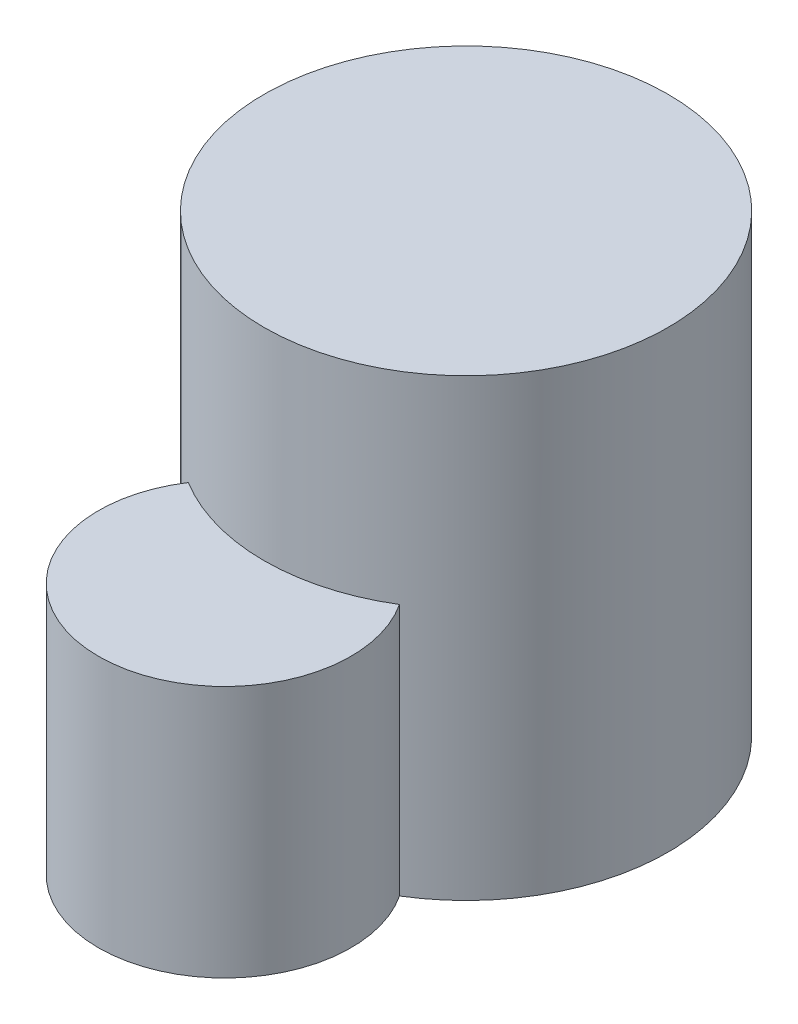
from build123d import *

# Parameters (mm, degrees)
SKETCH_1_R      = 8
EXTRUDE_1_DEPTH = 18
SKETCH_2_R      = 5
EXTRUDE_2_DEPTH = 10


with BuildPart() as part:
    # Sketch 1 → Extrude 1 (new body)
    with BuildSketch(Plane(origin=(0, 0, 0), x_dir=(1, 0, 0), z_dir=(0, 1, 0))):
        with Locations(Location((0, 0, 0), (0, 0, 270))):
            Circle(SKETCH_1_R)
    extrude(amount=EXTRUDE_1_DEPTH)

    # Sketch 2 → Extrude 2 (add)
    with BuildSketch(Plane(origin=(0, 0, 0), x_dir=(1, 0, 0), z_dir=(0, 1, 0))):
        with Locations((0, -9.558619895)):
            Circle(SKETCH_2_R)
    extrude(amount=EXTRUDE_2_DEPTH)


solid = part.part
